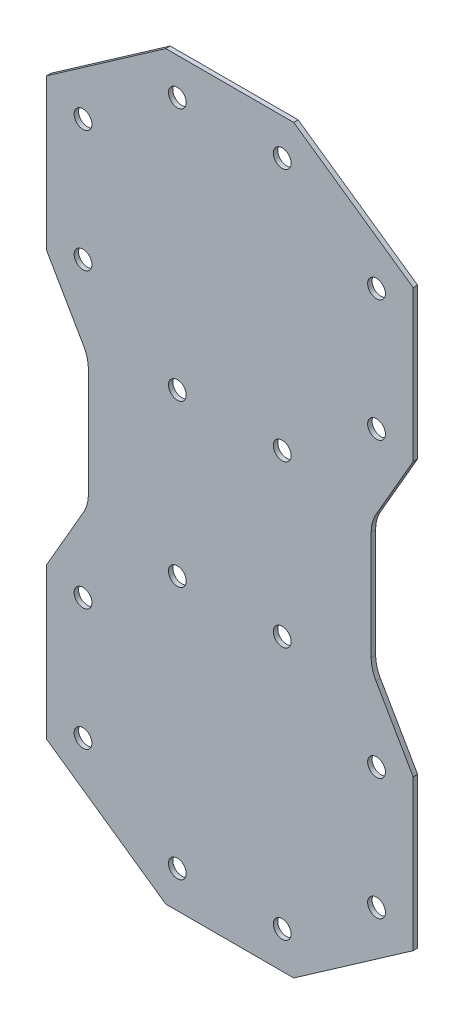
from build123d import *

# Parameters (mm, degrees)
MAIN_PLATE_DEPTH   = 12.7
SKETCH5_R          = 25.4
CUT_EXTRUDE1_DEPTH = 12.7


with BuildPart() as part:
    # Sketch3 → Main Plate (new body)
    with BuildSketch(Plane(origin=(0, 0, 0), x_dir=(0, 1, 0), z_dir=(0, 0, 1))):
        with BuildLine():
            Line((201.663107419, -523.855268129), (-228.234235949, -523.855268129))
            Line((-228.234235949, -523.855268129), (-466.324268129, -182.70492307))
            Line((-466.324268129, -182.70492307), (-466.324268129, 182.70492307))
            Line((-466.324268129, 182.70492307), (-228.234235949, 523.855268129))
            Line((-228.234235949, 523.855268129), (201.663107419, 523.855268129))
            Line((201.663107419, 523.855268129), (385.932842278, 417.467087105))
            ThreePointArc((385.932842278, 417.467087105), (410.436827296, 407.317204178), (436.732842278, 403.855268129))
            Line((436.732842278, 403.855268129), (746.653157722, 403.855268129))
            ThreePointArc((746.653157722, 403.855268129), (772.949172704, 407.317204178), (797.453157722, 417.467087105))
            Line((797.453157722, 417.467087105), (981.722892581, 523.855268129))
            Line((981.722892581, 523.855268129), (1411.620235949, 523.855268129))
            Line((1411.620235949, 523.855268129), (1649.710268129, 182.70492307))
            Line((1649.710268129, 182.70492307), (1649.710268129, -182.70492307))
            Line((1649.710268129, -182.70492307), (1411.620235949, -523.855268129))
            Line((1411.620235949, -523.855268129), (981.722892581, -523.855268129))
            Line((981.722892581, -523.855268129), (797.453157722, -417.467087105))
            ThreePointArc((797.453157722, -417.467087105), (772.949172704, -407.317204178), (746.653157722, -403.855268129))
            Line((746.653157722, -403.855268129), (436.732842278, -403.855268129))
            ThreePointArc((436.732842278, -403.855268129), (410.436827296, -407.317204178), (385.932842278, -417.467087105))
            Line((385.932842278, -417.467087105), (201.663107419, -523.855268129))
        make_face()
    extrude(amount=MAIN_PLATE_DEPTH)

    # Sketch5 → Cut-Extrude1 (cut)
    with BuildSketch(Plane(origin=(0, 0, 0), x_dir=(0, 1, 0), z_dir=(0, 0, 1))):
        with Locations(Location((-173.588730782, 419.080268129, 0), (0, 0, 270))):
            Circle(SKETCH5_R)
        with Locations(Location((173.588730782, 419.080268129, 0), (0, 0, 270))):
            Circle(SKETCH5_R)
        with Locations(Location((361.549268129, 149.758610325, 0), (0, 0, 270))):
            Circle(SKETCH5_R)
        with Locations(Location((361.549268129, -149.758610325, 0), (0, 0, 270))):
            Circle(SKETCH5_R)
        with Locations(Location((173.588730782, -419.080268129, 0), (0, 0, 270))):
            Circle(SKETCH5_R)
        with Locations(Location((-173.588730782, -419.080268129, 0), (0, 0, 270))):
            Circle(SKETCH5_R)
        with Locations(Location((-361.549268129, -149.758610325, 0), (0, 0, 270))):
            Circle(SKETCH5_R)
        with Locations(Location((-361.549268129, 149.758610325, 0), (0, 0, 270))):
            Circle(SKETCH5_R)
        with Locations(Location((1356.974730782, -419.080268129, 0), (0, 0, 270))):
            Circle(SKETCH5_R)
        with Locations(Location((821.836731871, 149.758610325, 0), (0, 0, 270))):
            Circle(SKETCH5_R)
        with Locations(Location((1544.935268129, -149.758610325, 0), (0, 0, 270))):
            Circle(SKETCH5_R)
        with Locations(Location((821.836731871, -149.758610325, 0), (0, 0, 270))):
            Circle(SKETCH5_R)
        with Locations(Location((1356.974730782, 419.080268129, 0), (0, 0, 270))):
            Circle(SKETCH5_R)
        with Locations(Location((1544.935268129, 149.758610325, 0), (0, 0, 270))):
            Circle(SKETCH5_R)
        with Locations(Location((1009.797269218, 419.080268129, 0), (0, 0, 270))):
            Circle(SKETCH5_R)
        with Locations(Location((1009.797269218, -419.080268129, 0), (0, 0, 270))):
            Circle(SKETCH5_R)
    extrude(amount=CUT_EXTRUDE1_DEPTH, mode=Mode.SUBTRACT)


solid = part.part
